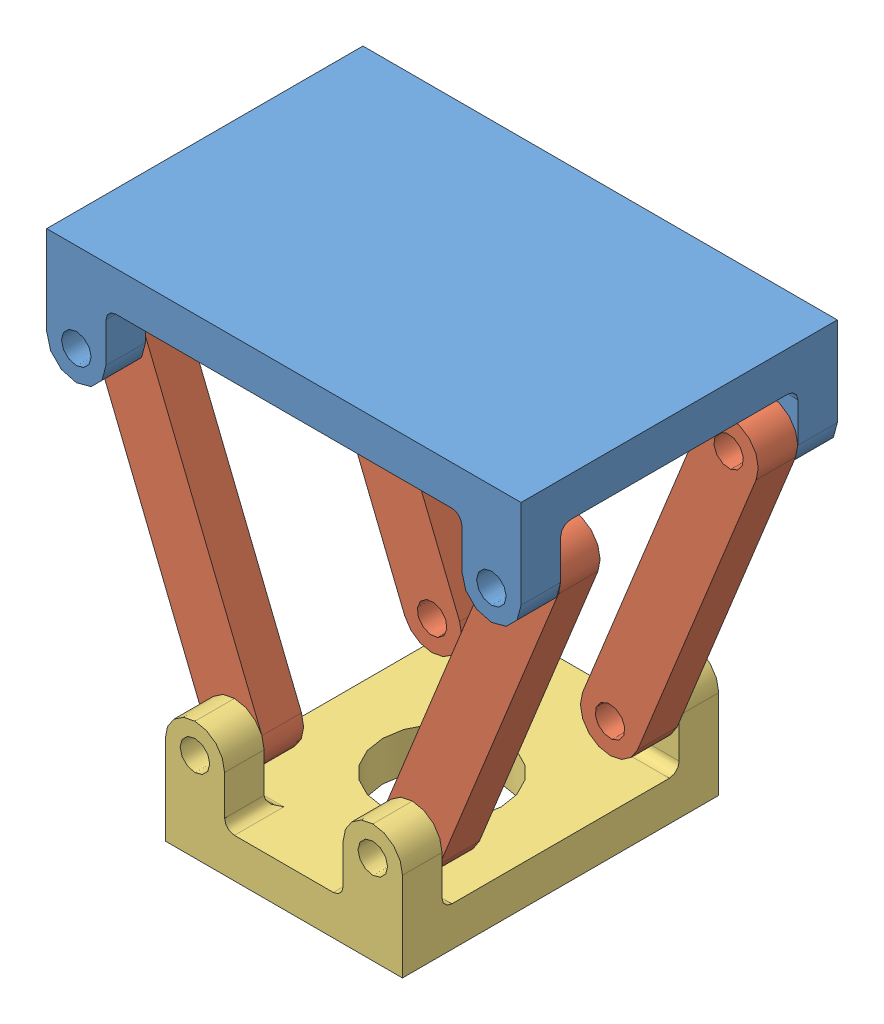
SolidWorks assembly STAND.SLDASM, configuration Default (file format 4100). Lengths in mm.
Overall size (316.31 302.67 203.2).
6 component instances, 3 part files, 16 mates.
Components (placement in the parent):
- base plate wide-1: base plate wide.SLDPRT [Default] at (-36.9814 300.0936 19.4686) x (1 0 0) z (0 -1 0) size (304.8 203.2 76.2)
- Part2-5: Part2.SLDPRT [Default] at (20.1686 54.5721 82.9686) x (0.375 0.927025 0) z (0 0 1) size (241.3 38.1 25.4)
- Part2-7: Part2.SLDPRT [Default] at (-170.3314 242.9436 -44.0314) x (0.375 -0.927025 0) z (0 0 1) size (241.3 38.1 25.4)
- Part2-8: Part2.SLDPRT [Default] at (-170.3314 242.9436 82.9686) x (0.375 -0.927025 0) z (0 0 1) size (241.3 38.1 25.4)
- Part2-9: Part2.SLDPRT [Default] at (96.3686 242.9436 -44.0314) x (-0.375 -0.927025 0) z (0 0 1) size (241.3 38.1 25.4)
- base plate-5: base plate.SLDPRT [Default] at (-36.9814 -2.5779 19.4686) x (1 0 0) z (0 1 0) size (152.4 203.2 76.2)
Mates (geometry in assembly coordinates):
- Coincident15: coincident anti-aligned: plane of base plate wide-1 through (115.4186 223.8936 -56.7314) normal (0 0 1); plane of Part2-9 through (96.3686 242.9436 -56.7314) normal (0 0 -1)
- Coincident16: coincident anti-aligned: plane of base plate wide-1 through (-189.3814 223.8936 -56.7314) normal (0 0 1); plane of Part2-7 through (-170.3314 242.9436 -56.7314) normal (0 0 -1)
- Coincident17: coincident anti-aligned: plane of base plate wide-1 through (-189.3814 223.8936 95.6686) normal (0 0 -1); plane of Part2-8 through (-170.3314 242.9436 95.6686) normal (0 0 1)
- Coincident18: coincident anti-aligned: plane of base plate wide-1 through (115.4186 223.8936 95.6686) normal (0 0 -1); plane of Part2-5 through (20.1686 54.5721 95.6686) normal (0 0 1)
- Coincident19: coincident anti-aligned: plane of Part2-9 through (96.3686 242.9436 -56.7314) normal (0 0 -1); plane of base plate-5 through (39.2186 73.6221 -56.7314) normal (0 0 1)
- Coincident20: coincident anti-aligned: plane of Part2-5 through (20.1686 54.5721 95.6686) normal (0 0 1); plane of base plate-5 through (39.2186 73.6221 95.6686) normal (0 0 -1)
- Concentric1: concentric aligned: cylinder of Part2-7 through (-94.1314 54.5721 -31.3314) axis (0 0 -1) radius 9.525; cylinder of base plate-5 through (-94.1314 54.5721 121.0687) axis (0 0 -1) radius 9.525
- Concentric2: concentric aligned: cylinder of base plate wide-1 through (-170.3314 242.9436 121.0686) axis (0 0 -1) radius 9.525; cylinder of Part2-7 through (-170.3314 242.9436 -31.3314) axis (0 0 -1) radius 9.525
- Concentric3: concentric aligned: cylinder of Part2-9 through (20.1686 54.5721 -31.3314) axis (0 0 -1) radius 9.525; cylinder of base plate-5 through (20.1686 54.5721 121.0687) axis (0 0 -1) radius 9.525
- Concentric4: concentric aligned: cylinder of base plate wide-1 through (96.3686 242.9436 121.0686) axis (0 0 -1) radius 9.525; cylinder of Part2-9 through (96.3686 242.9436 -31.3314) axis (0 0 -1) radius 9.525
- Concentric5: concentric anti-aligned: cylinder of base plate wide-1 through (96.3686 242.9436 -82.1314) axis (0 0 1) radius 9.525; cylinder of Part2-5 through (96.3686 242.9436 95.6686) axis (0 0 -1) radius 9.525
- Concentric6: concentric anti-aligned: cylinder of Part2-5 through (20.1686 54.5721 95.6686) axis (0 0 -1) radius 9.525; cylinder of base plate-5 through (20.1686 54.5721 -82.1314) axis (0 0 1) radius 9.525
- Concentric7: concentric anti-aligned: cylinder of Part2-8 through (-94.1314 54.5721 95.6686) axis (0 0 -1) radius 9.525; cylinder of base plate-5 through (-94.1314 54.5721 -82.1314) axis (0 0 1) radius 9.525
- Concentric8: concentric anti-aligned: cylinder of base plate wide-1 through (-170.3314 242.9436 -82.1314) axis (0 0 1) radius 9.525; cylinder of Part2-8 through (-170.3314 242.9436 95.6686) axis (0 0 -1) radius 9.525
- Coincident26: coincident aligned: unknown of base plate-5
- PLANE1: unknown: line of base plate wide-1 through (-36.9814 300.0936 -82.1314) axis (0 0 1)
